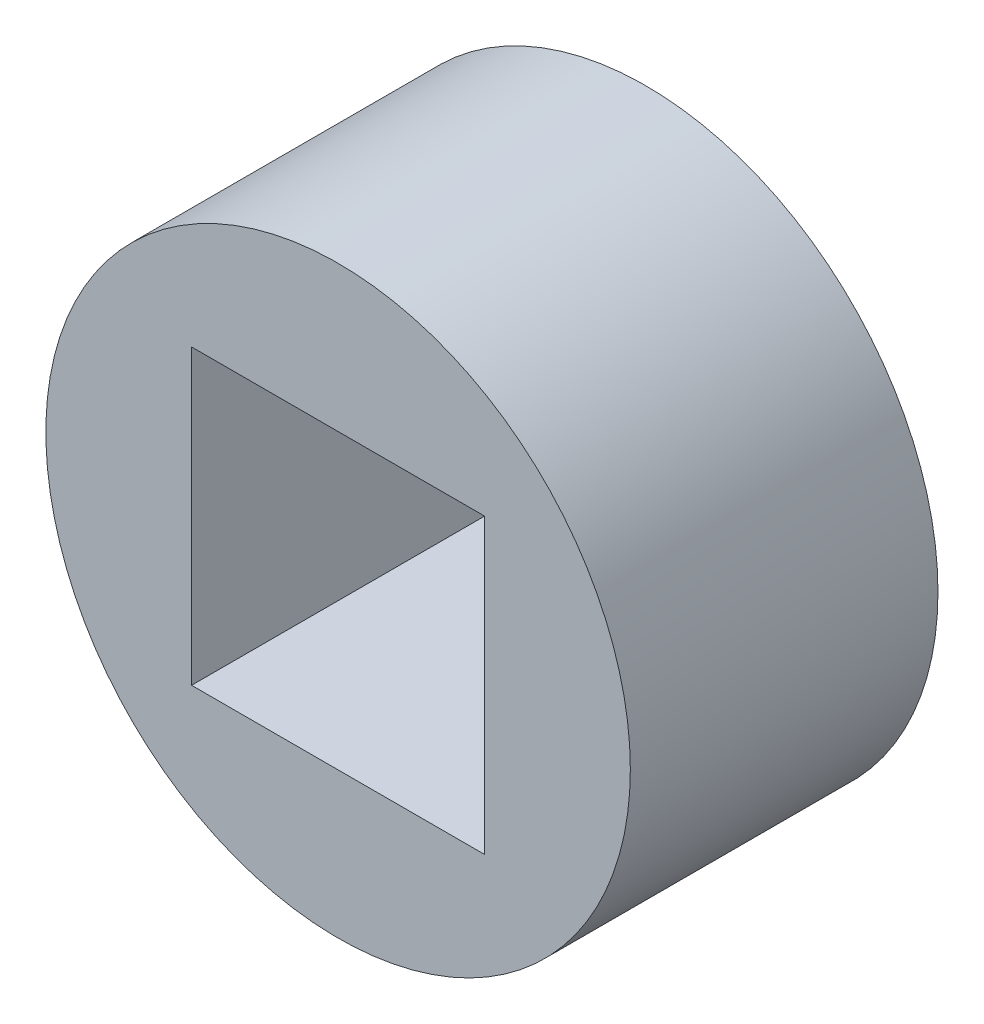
from build123d import *

# Parameters (mm, degrees)
SKETCH1_R           = 9.5
SKETCH1_W           = 9.525
SKETCH1_H           = 9.525
BOSS_EXTRUDE1_DEPTH = 10


with BuildPart() as part:
    # Sketch1 → Boss-Extrude1 (new body)
    with BuildSketch(Plane.XY):
        Circle(SKETCH1_R)
        Rectangle(SKETCH1_W, SKETCH1_H, mode=Mode.SUBTRACT)
    extrude(amount=BOSS_EXTRUDE1_DEPTH)


solid = part.part
